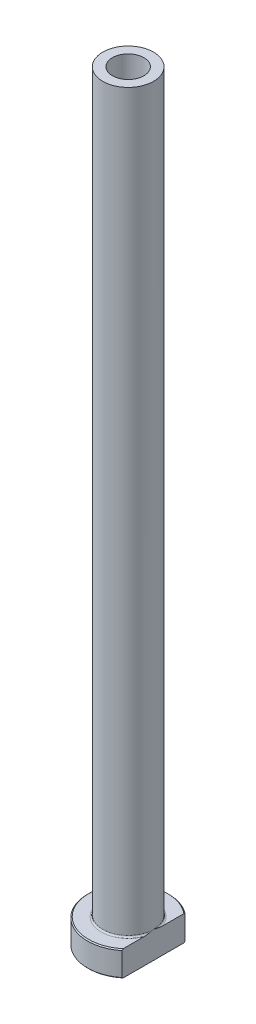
ISO-10303-21;
HEADER;
FILE_DESCRIPTION(('STEP AP214'),'2;1');
FILE_NAME('part.step','',(''),(''),'','','');
FILE_SCHEMA(('AUTOMOTIVE_DESIGN { 1 0 10303 214 1 1 1 1 }'));
ENDSEC;
DATA;
#1=APPLICATION_CONTEXT('core data for automotive mechanical design processes');
#2=APPLICATION_PROTOCOL_DEFINITION('international standard','automotive_design',2000,#1);
#3=PRODUCT_CONTEXT('',#1,'mechanical');
#4=PRODUCT('Part','Part','',(#3));
#5=PRODUCT_RELATED_PRODUCT_CATEGORY('part','',(#4));
#6=PRODUCT_DEFINITION_FORMATION('','',#4);
#7=PRODUCT_DEFINITION_CONTEXT('part definition',#1,'design');
#8=PRODUCT_DEFINITION('design','',#6,#7);
#9=PRODUCT_DEFINITION_SHAPE('','',#8);
#10=(LENGTH_UNIT() NAMED_UNIT(*) SI_UNIT(.MILLI.,.METRE.));
#11=(NAMED_UNIT(*) PLANE_ANGLE_UNIT() SI_UNIT($,.RADIAN.));
#12=(NAMED_UNIT(*) SI_UNIT($,.STERADIAN.) SOLID_ANGLE_UNIT());
#13=UNCERTAINTY_MEASURE_WITH_UNIT(LENGTH_MEASURE(1.E-05),#10,'distance_accuracy_value','');
#14=(GEOMETRIC_REPRESENTATION_CONTEXT(3) GLOBAL_UNCERTAINTY_ASSIGNED_CONTEXT((#13)) GLOBAL_UNIT_ASSIGNED_CONTEXT((#10,
#11,#12)) REPRESENTATION_CONTEXT('',''));
#15=CARTESIAN_POINT('',(0.,0.,0.));
#16=DIRECTION('',(0.,0.,1.));
#17=DIRECTION('',(1.,0.,0.));
#18=AXIS2_PLACEMENT_3D('',#15,#16,#17);
#19=CARTESIAN_POINT('',(0.,92.1876809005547,0.));
#20=DIRECTION('',(0.,1.,0.));
#21=DIRECTION('',(0.,0.,1.));
#22=AXIS2_PLACEMENT_3D('',#19,#20,#21);
#23=CYLINDRICAL_SURFACE('',#22,3.1);
#24=CARTESIAN_POINT('',(0.,150.,0.));
#25=DIRECTION('',(0.,1.,0.));
#26=DIRECTION('',(0.,0.,1.));
#27=AXIS2_PLACEMENT_3D('',#24,#25,#26);
#28=CIRCLE('',#27,3.1);
#29=CARTESIAN_POINT('',(0.,150.,3.1));
#30=VERTEX_POINT('',#29);
#31=EDGE_CURVE('E167',#30,#30,#28,.T.);
#32=ORIENTED_EDGE('',*,*,#31,.T.);
#33=EDGE_LOOP('',(#32));
#34=FACE_BOUND('',#33,.T.);
#35=CARTESIAN_POINT('',(0.,105.,0.));
#36=DIRECTION('',(0.,1.,0.));
#37=DIRECTION('',(0.,0.,1.));
#38=AXIS2_PLACEMENT_3D('',#35,#36,#37);
#39=CIRCLE('',#38,3.1);
#40=CARTESIAN_POINT('',(0.,105.,3.1));
#41=VERTEX_POINT('',#40);
#42=EDGE_CURVE('E170',#41,#41,#39,.T.);
#43=ORIENTED_EDGE('',*,*,#42,.F.);
#44=EDGE_LOOP('',(#43));
#45=FACE_BOUND('',#44,.T.);
#46=ADVANCED_FACE('F32',(#34,#45),#23,.F.);
#47=CARTESIAN_POINT('',(-3.1,150.,0.));
#48=DIRECTION('',(0.,1.,0.));
#49=DIRECTION('',(0.,0.,1.));
#50=AXIS2_PLACEMENT_3D('',#47,#48,#49);
#51=PLANE('',#50);
#52=CARTESIAN_POINT('',(0.,150.,0.));
#53=DIRECTION('',(0.,1.,0.));
#54=DIRECTION('',(0.,0.,1.));
#55=AXIS2_PLACEMENT_3D('',#52,#53,#54);
#56=CIRCLE('',#55,5.00000000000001);
#57=CARTESIAN_POINT('',(0.,150.,5.00000000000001));
#58=VERTEX_POINT('',#57);
#59=EDGE_CURVE('E174',#58,#58,#56,.T.);
#60=ORIENTED_EDGE('',*,*,#59,.T.);
#61=EDGE_LOOP('',(#60));
#62=FACE_BOUND('',#61,.T.);
#63=ORIENTED_EDGE('',*,*,#31,.F.);
#64=EDGE_LOOP('',(#63));
#65=FACE_BOUND('',#64,.T.);
#66=ADVANCED_FACE('F157',(#62,#65),#51,.T.);
#67=CARTESIAN_POINT('',(0.,92.1876809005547,0.));
#68=DIRECTION('',(0.,1.,0.));
#69=DIRECTION('',(0.,0.,1.));
#70=AXIS2_PLACEMENT_3D('',#67,#68,#69);
#71=CYLINDRICAL_SURFACE('',#70,5.);
#72=CARTESIAN_POINT('',(0.,5.3,0.));
#73=DIRECTION('',(0.,1.,0.));
#74=DIRECTION('',(0.,0.,1.));
#75=AXIS2_PLACEMENT_3D('',#72,#73,#74);
#76=CIRCLE('',#75,5.);
#77=CARTESIAN_POINT('',(5.,5.3,0.));
#78=VERTEX_POINT('',#77);
#79=EDGE_CURVE('E180',#78,#78,#76,.T.);
#80=ORIENTED_EDGE('',*,*,#79,.T.);
#81=EDGE_LOOP('',(#80));
#82=FACE_BOUND('',#81,.T.);
#83=ORIENTED_EDGE('',*,*,#59,.F.);
#84=EDGE_LOOP('',(#83));
#85=FACE_BOUND('',#84,.T.);
#86=ADVANCED_FACE('F162',(#82,#85),#71,.T.);
#87=CARTESIAN_POINT('',(-4.99999999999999,5.,0.));
#88=DIRECTION('',(0.,1.,0.));
#89=DIRECTION('',(0.,0.,1.));
#90=AXIS2_PLACEMENT_3D('',#87,#88,#89);
#91=PLANE('',#90);
#92=DIRECTION('',(0.,0.,1.));
#93=VECTOR('',#92,1.);
#94=CARTESIAN_POINT('',(5.,5.,0.));
#95=LINE('',#94,#93);
#96=CARTESIAN_POINT('',(5.,5.,-5.98665181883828));
#97=VERTEX_POINT('',#96);
#98=CARTESIAN_POINT('',(5.,5.,-1.7578395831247));
#99=VERTEX_POINT('',#98);
#100=EDGE_CURVE('E54',#97,#99,#95,.T.);
#101=ORIENTED_EDGE('',*,*,#100,.F.);
#102=CARTESIAN_POINT('',(0.,5.,0.));
#103=DIRECTION('',(0.,1.,0.));
#104=DIRECTION('',(0.,0.,1.));
#105=AXIS2_PLACEMENT_3D('',#102,#103,#104);
#106=CIRCLE('',#105,7.79999999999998);
#107=CARTESIAN_POINT('',(4.99999999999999,5.,5.98665181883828));
#108=VERTEX_POINT('',#107);
#109=EDGE_CURVE('E186',#97,#108,#106,.T.);
#110=ORIENTED_EDGE('',*,*,#109,.T.);
#111=CARTESIAN_POINT('',(5.,5.,1.7578395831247));
#112=VERTEX_POINT('',#111);
#113=EDGE_CURVE('E134',#112,#108,#95,.T.);
#114=ORIENTED_EDGE('',*,*,#113,.F.);
#115=CARTESIAN_POINT('',(0.,5.,0.));
#116=DIRECTION('',(0.,1.,0.));
#117=DIRECTION('',(0.,0.,1.));
#118=AXIS2_PLACEMENT_3D('',#115,#116,#117);
#119=CIRCLE('',#118,5.3);
#120=EDGE_CURVE('E183',#112,#99,#119,.F.);
#121=ORIENTED_EDGE('',*,*,#120,.T.);
#122=EDGE_LOOP('',(#101,#110,#114,#121));
#123=FACE_BOUND('',#122,.T.);
#124=ADVANCED_FACE('F197',(#123),#91,.T.);
#125=CARTESIAN_POINT('',(0.,92.1876809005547,0.));
#126=DIRECTION('',(0.,1.,0.));
#127=DIRECTION('',(0.,0.,1.));
#128=AXIS2_PLACEMENT_3D('',#125,#126,#127);
#129=CYLINDRICAL_SURFACE('',#128,7.99999999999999);
#130=DIRECTION('',(0.,-1.,0.));
#131=VECTOR('',#130,1.);
#132=CARTESIAN_POINT('',(4.99999999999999,150.,6.24499799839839));
#133=LINE('',#132,#131);
#134=CARTESIAN_POINT('',(4.99999999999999,4.79999999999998,6.24499799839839));
#135=VERTEX_POINT('',#134);
#136=CARTESIAN_POINT('',(4.99999999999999,0.200000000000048,6.24499799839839));
#137=VERTEX_POINT('',#136);
#138=EDGE_CURVE('E82',#135,#137,#133,.T.);
#139=ORIENTED_EDGE('',*,*,#138,.F.);
#140=CARTESIAN_POINT('',(0.,4.79999999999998,0.));
#141=DIRECTION('',(0.,1.,0.));
#142=DIRECTION('',(0.,0.,1.));
#143=AXIS2_PLACEMENT_3D('',#140,#141,#142);
#144=CIRCLE('',#143,7.99999999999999);
#145=CARTESIAN_POINT('',(5.,4.79999999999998,-6.24499799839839));
#146=VERTEX_POINT('',#145);
#147=EDGE_CURVE('E95',#135,#146,#144,.F.);
#148=ORIENTED_EDGE('',*,*,#147,.T.);
#149=DIRECTION('',(0.,-1.,0.));
#150=VECTOR('',#149,1.);
#151=CARTESIAN_POINT('',(5.,150.,-6.24499799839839));
#152=LINE('',#151,#150);
#153=CARTESIAN_POINT('',(5.,0.200000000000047,-6.24499799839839));
#154=VERTEX_POINT('',#153);
#155=EDGE_CURVE('E192',#146,#154,#152,.T.);
#156=ORIENTED_EDGE('',*,*,#155,.T.);
#157=CARTESIAN_POINT('',(0.,0.200000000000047,0.));
#158=DIRECTION('',(0.,-1.,0.));
#159=DIRECTION('',(0.,0.,-1.));
#160=AXIS2_PLACEMENT_3D('',#157,#158,#159);
#161=CIRCLE('',#160,7.99999999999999);
#162=EDGE_CURVE('E98',#154,#137,#161,.F.);
#163=ORIENTED_EDGE('',*,*,#162,.T.);
#164=EDGE_LOOP('',(#139,#148,#156,#163));
#165=FACE_BOUND('',#164,.T.);
#166=ADVANCED_FACE('F190',(#165),#129,.T.);
#167=CARTESIAN_POINT('',(-7.99999999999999,0.,0.));
#168=DIRECTION('',(0.,-1.,0.));
#169=DIRECTION('',(0.,0.,-1.));
#170=AXIS2_PLACEMENT_3D('',#167,#168,#169);
#171=PLANE('',#170);
#172=CARTESIAN_POINT('',(0.,0.,0.));
#173=DIRECTION('',(0.,-1.,0.));
#174=DIRECTION('',(0.,0.,-1.));
#175=AXIS2_PLACEMENT_3D('',#172,#173,#174);
#176=CIRCLE('',#175,3.84999999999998);
#177=CARTESIAN_POINT('',(0.,0.,-3.84999999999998));
#178=VERTEX_POINT('',#177);
#179=EDGE_CURVE('E40',#178,#178,#176,.F.);
#180=ORIENTED_EDGE('',*,*,#179,.T.);
#181=EDGE_LOOP('',(#180));
#182=FACE_BOUND('',#181,.T.);
#183=DIRECTION('',(0.,0.,-1.));
#184=VECTOR('',#183,1.);
#185=CARTESIAN_POINT('',(4.99999999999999,0.,6.24499799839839));
#186=LINE('',#185,#184);
#187=CARTESIAN_POINT('',(4.99999999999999,0.,5.98665181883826));
#188=VERTEX_POINT('',#187);
#189=CARTESIAN_POINT('',(5.,0.,-5.98665181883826));
#190=VERTEX_POINT('',#189);
#191=EDGE_CURVE('E47',#188,#190,#186,.T.);
#192=ORIENTED_EDGE('',*,*,#191,.F.);
#193=CARTESIAN_POINT('',(0.,0.,0.));
#194=DIRECTION('',(0.,-1.,0.));
#195=DIRECTION('',(0.,0.,-1.));
#196=AXIS2_PLACEMENT_3D('',#193,#194,#195);
#197=CIRCLE('',#196,7.79999999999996);
#198=EDGE_CURVE('E92',#188,#190,#197,.T.);
#199=ORIENTED_EDGE('',*,*,#198,.T.);
#200=EDGE_LOOP('',(#192,#199));
#201=FACE_BOUND('',#200,.T.);
#202=ADVANCED_FACE('F91',(#182,#201),#171,.T.);
#203=CARTESIAN_POINT('',(0.,92.1876809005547,0.));
#204=DIRECTION('',(0.,1.,0.));
#205=DIRECTION('',(0.,0.,1.));
#206=AXIS2_PLACEMENT_3D('',#203,#204,#205);
#207=CYLINDRICAL_SURFACE('',#206,3.35);
#208=CARTESIAN_POINT('',(0.,0.499999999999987,0.));
#209=DIRECTION('',(0.,-1.,0.));
#210=DIRECTION('',(0.,0.,-1.));
#211=AXIS2_PLACEMENT_3D('',#208,#209,#210);
#212=CIRCLE('',#211,3.35);
#213=CARTESIAN_POINT('',(0.,0.499999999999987,-3.35));
#214=VERTEX_POINT('',#213);
#215=EDGE_CURVE('E11',#214,#214,#212,.T.);
#216=ORIENTED_EDGE('',*,*,#215,.T.);
#217=EDGE_LOOP('',(#216));
#218=FACE_BOUND('',#217,.T.);
#219=CARTESIAN_POINT('',(0.,93.,0.));
#220=DIRECTION('',(0.,1.,0.));
#221=DIRECTION('',(0.,0.,1.));
#222=AXIS2_PLACEMENT_3D('',#219,#220,#221);
#223=CIRCLE('',#222,3.35);
#224=CARTESIAN_POINT('',(0.,93.,3.35));
#225=VERTEX_POINT('',#224);
#226=EDGE_CURVE('E172',#225,#225,#223,.T.);
#227=ORIENTED_EDGE('',*,*,#226,.T.);
#228=EDGE_LOOP('',(#227));
#229=FACE_BOUND('',#228,.T.);
#230=ADVANCED_FACE('F215',(#218,#229),#207,.F.);
#231=CARTESIAN_POINT('',(0.,93.,0.));
#232=DIRECTION('',(0.,-1.,0.));
#233=DIRECTION('',(0.,0.,-1.));
#234=AXIS2_PLACEMENT_3D('',#231,#232,#233);
#235=CONICAL_SURFACE('',#234,3.35,0.0208303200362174);
#236=ORIENTED_EDGE('',*,*,#42,.T.);
#237=EDGE_LOOP('',(#236));
#238=FACE_BOUND('',#237,.T.);
#239=ORIENTED_EDGE('',*,*,#226,.F.);
#240=EDGE_LOOP('',(#239));
#241=FACE_BOUND('',#240,.T.);
#242=ADVANCED_FACE('F111',(#238,#241),#235,.F.);
#243=CARTESIAN_POINT('',(0.,5.3,0.));
#244=DIRECTION('',(0.,1.,0.));
#245=DIRECTION('',(0.,0.,1.));
#246=AXIS2_PLACEMENT_3D('',#243,#244,#245);
#247=TOROIDAL_SURFACE('',#246,5.3,0.3);
#248=ORIENTED_EDGE('',*,*,#120,.F.);
#249=CARTESIAN_POINT('',(5.,5.3,0.));
#250=CARTESIAN_POINT('',(5.,5.30000062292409,-1.31469405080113E-10));
#251=CARTESIAN_POINT('',(5.,5.30000124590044,2.52759284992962E-07));
#252=CARTESIAN_POINT('',(5.,5.30000240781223,9.47164481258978E-07));
#253=CARTESIAN_POINT('',(5.,5.30000293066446,1.40594053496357E-06));
#254=CARTESIAN_POINT('',(5.,5.30000402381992,2.50637628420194E-06));
#255=CARTESIAN_POINT('',(5.,5.30000457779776,3.16588935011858E-06));
#256=CARTESIAN_POINT('',(5.,5.30000556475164,4.5285999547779E-06));
#257=CARTESIAN_POINT('',(5.,5.30000600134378,5.22939475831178E-06));
#258=CARTESIAN_POINT('',(5.,5.30000763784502,7.96122031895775E-06));
#259=CARTESIAN_POINT('',(5.,5.30000875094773,1.00477415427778E-05));
#260=CARTESIAN_POINT('',(5.,5.30001056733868,1.41660880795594E-05));
#261=CARTESIAN_POINT('',(5.,5.30001129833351,1.6186178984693E-05));
#262=CARTESIAN_POINT('',(5.,5.3000143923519,2.47865751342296E-05));
#263=CARTESIAN_POINT('',(5.,5.30001672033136,3.13830297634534E-05));
#264=CARTESIAN_POINT('',(5.,5.30002012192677,4.38084236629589E-05));
#265=CARTESIAN_POINT('',(5.,5.30002133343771,4.95992753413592E-05));
#266=CARTESIAN_POINT('',(5.,5.30003020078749,9.27862636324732E-05));
#267=CARTESIAN_POINT('',(5.,5.30003696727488,0.000130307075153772));
#268=CARTESIAN_POINT('',(4.99999999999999,5.30006659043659,0.000278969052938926));
#269=CARTESIAN_POINT('',(4.99999999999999,5.30009481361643,0.000389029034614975));
#270=CARTESIAN_POINT('',(5.,5.30020506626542,0.000826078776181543));
#271=CARTESIAN_POINT('',(5.,5.30028365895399,0.00115365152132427));
#272=CARTESIAN_POINT('',(4.99999999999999,5.30059919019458,0.0024592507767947));
#273=CARTESIAN_POINT('',(4.99999999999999,5.30084048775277,0.00343651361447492));
#274=CARTESIAN_POINT('',(5.,5.30184626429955,0.00752058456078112));
#275=CARTESIAN_POINT('',(5.,5.30260525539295,0.0106283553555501));
#276=CARTESIAN_POINT('',(4.99999999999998,5.30996461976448,0.0407482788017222));
#277=CARTESIAN_POINT('',(4.99999999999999,5.31658985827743,0.0677561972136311));
#278=CARTESIAN_POINT('',(5.,5.32953319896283,0.120688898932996));
#279=CARTESIAN_POINT('',(5.,5.33585289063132,0.146613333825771));
#280=CARTESIAN_POINT('',(4.99999999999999,5.34926050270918,0.201795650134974));
#281=CARTESIAN_POINT('',(5.,5.35634306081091,0.231054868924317));
#282=CARTESIAN_POINT('',(5.,5.37050252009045,0.289917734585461));
#283=CARTESIAN_POINT('',(5.,5.37757848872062,0.319521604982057));
#284=CARTESIAN_POINT('',(5.,5.39452602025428,0.391032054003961));
#285=CARTESIAN_POINT('',(5.,5.40434071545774,0.432952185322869));
#286=CARTESIAN_POINT('',(5.,5.42340141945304,0.515763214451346));
#287=CARTESIAN_POINT('',(5.,5.43265559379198,0.556652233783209));
#288=CARTESIAN_POINT('',(5.,5.45710553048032,0.667075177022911));
#289=CARTESIAN_POINT('',(5.,5.47194176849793,0.736689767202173));
#290=CARTESIAN_POINT('',(5.,5.50018229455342,0.876836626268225));
#291=CARTESIAN_POINT('',(5.,5.51357312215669,0.947371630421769));
#292=CARTESIAN_POINT('',(5.,5.53930921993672,1.09497328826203));
#293=CARTESIAN_POINT('',(5.,5.55146217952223,1.17207432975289));
#294=CARTESIAN_POINT('',(5.,5.57239669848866,1.32672649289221));
#295=CARTESIAN_POINT('',(5.,5.58117877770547,1.40427754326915));
#296=CARTESIAN_POINT('',(5.,5.59499725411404,1.56873827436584));
#297=CARTESIAN_POINT('',(5.,5.59948802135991,1.65570044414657));
#298=CARTESIAN_POINT('',(5.,5.60018885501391,1.785353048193));
#299=CARTESIAN_POINT('',(5.,5.5994521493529,1.82802575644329));
#300=CARTESIAN_POINT('',(5.,5.59559364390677,1.91325081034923));
#301=CARTESIAN_POINT('',(5.,5.59247319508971,1.95580321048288));
#302=CARTESIAN_POINT('',(5.,5.5838324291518,2.03512365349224));
#303=CARTESIAN_POINT('',(5.,5.57867386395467,2.07192937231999));
#304=CARTESIAN_POINT('',(5.,5.56543793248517,2.14526756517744));
#305=CARTESIAN_POINT('',(5.,5.55734203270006,2.18179676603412));
#306=CARTESIAN_POINT('',(5.,5.53718005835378,2.25427226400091));
#307=CARTESIAN_POINT('',(5.,5.52507057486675,2.29020746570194));
#308=CARTESIAN_POINT('',(5.,5.50270928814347,2.34223029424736));
#309=CARTESIAN_POINT('',(5.,5.49457811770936,2.35922314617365));
#310=CARTESIAN_POINT('',(5.,5.47657809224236,2.39224900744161));
#311=CARTESIAN_POINT('',(5.,5.46671281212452,2.40828390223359));
#312=CARTESIAN_POINT('',(5.,5.44695893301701,2.43579467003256));
#313=CARTESIAN_POINT('',(5.,5.43745879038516,2.44754592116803));
#314=CARTESIAN_POINT('',(5.,5.4167791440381,2.46946476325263));
#315=CARTESIAN_POINT('',(5.,5.4056054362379,2.47963758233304));
#316=CARTESIAN_POINT('',(5.,5.38617750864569,2.49393642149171));
#317=CARTESIAN_POINT('',(5.,5.3785164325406,2.49886271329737));
#318=CARTESIAN_POINT('',(5.,5.362527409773,2.50749953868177));
#319=CARTESIAN_POINT('',(5.,5.35419984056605,2.51121075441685));
#320=CARTESIAN_POINT('',(5.,5.33690648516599,2.51712941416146));
#321=CARTESIAN_POINT('',(5.,5.32793451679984,2.5193192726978));
#322=CARTESIAN_POINT('',(5.,5.30973576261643,2.52185978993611));
#323=CARTESIAN_POINT('',(5.,5.30050931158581,2.52221275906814));
#324=CARTESIAN_POINT('',(5.,5.28349166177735,2.52112455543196));
#325=CARTESIAN_POINT('',(5.,5.27568322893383,2.51993178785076));
#326=CARTESIAN_POINT('',(5.,5.26036860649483,2.51628294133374));
#327=CARTESIAN_POINT('',(5.,5.25286261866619,2.51382603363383));
#328=CARTESIAN_POINT('',(5.,5.2359026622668,2.50685484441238));
#329=CARTESIAN_POINT('',(5.,5.22661875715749,2.50192984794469));
#330=CARTESIAN_POINT('',(5.,5.20895514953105,2.49066548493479));
#331=CARTESIAN_POINT('',(5.,5.20057756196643,2.48432291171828));
#332=CARTESIAN_POINT('',(5.,5.1798700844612,2.46645212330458));
#333=CARTESIAN_POINT('',(5.,5.16824151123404,2.45411867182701));
#334=CARTESIAN_POINT('',(5.,5.14692461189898,2.42790849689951));
#335=CARTESIAN_POINT('',(5.,5.13723987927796,2.41402898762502));
#336=CARTESIAN_POINT('',(5.,5.11080706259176,2.37143175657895));
#337=CARTESIAN_POINT('',(5.,5.09628770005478,2.34134703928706));
#338=CARTESIAN_POINT('',(5.,5.07130349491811,2.27940731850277));
#339=CARTESIAN_POINT('',(5.,5.06087110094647,2.24754035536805));
#340=CARTESIAN_POINT('',(5.,5.03890359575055,2.16787245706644));
#341=CARTESIAN_POINT('',(5.,5.02913523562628,2.1195906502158));
#342=CARTESIAN_POINT('',(5.,5.01416953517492,2.02224928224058));
#343=CARTESIAN_POINT('',(5.,5.00898637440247,1.97318778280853));
#344=CARTESIAN_POINT('',(5.,5.00220823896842,1.87635767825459));
#345=CARTESIAN_POINT('',(5.,5.00050709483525,1.82859609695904));
#346=CARTESIAN_POINT('',(5.,4.999691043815,1.73330165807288));
#347=CARTESIAN_POINT('',(5.,5.00056327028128,1.68576884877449));
#348=CARTESIAN_POINT('',(5.,5.00484296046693,1.57937770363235));
#349=CARTESIAN_POINT('',(5.,5.00880932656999,1.52054285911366));
#350=CARTESIAN_POINT('',(5.,5.01925964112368,1.40312974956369));
#351=CARTESIAN_POINT('',(5.,5.02574264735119,1.34455139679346));
#352=CARTESIAN_POINT('',(5.,5.04090087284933,1.22627662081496));
#353=CARTESIAN_POINT('',(5.,5.04962425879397,1.16658647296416));
#354=CARTESIAN_POINT('',(5.,5.06877923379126,1.04732463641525));
#355=CARTESIAN_POINT('',(5.,5.07921523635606,0.987753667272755));
#356=CARTESIAN_POINT('',(5.,5.10551698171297,0.846936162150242));
#357=CARTESIAN_POINT('',(5.,5.12196565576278,0.765799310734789));
#358=CARTESIAN_POINT('',(5.,5.15639716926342,0.604819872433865));
#359=CARTESIAN_POINT('',(5.,5.17436050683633,0.524973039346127));
#360=CARTESIAN_POINT('',(4.99999999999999,5.2092166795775,0.374726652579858));
#361=CARTESIAN_POINT('',(4.99999999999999,5.22599388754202,0.304300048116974));
#362=CARTESIAN_POINT('',(5.,5.25191105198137,0.196907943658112));
#363=CARTESIAN_POINT('',(5.,5.26090146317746,0.159905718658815));
#364=CARTESIAN_POINT('',(4.99999999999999,5.27881854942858,0.0865164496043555));
#365=CARTESIAN_POINT('',(4.99999999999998,5.28774391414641,0.0501291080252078));
#366=CARTESIAN_POINT('',(5.,5.2973962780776,0.0106218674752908));
#367=CARTESIAN_POINT('',(5.,5.29815688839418,0.00750762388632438));
#368=CARTESIAN_POINT('',(4.99999999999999,5.29916304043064,0.00342209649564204));
#369=CARTESIAN_POINT('',(4.99999999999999,5.29940309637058,0.00244985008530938));
#370=CARTESIAN_POINT('',(5.,5.29971711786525,0.00115049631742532));
#371=CARTESIAN_POINT('',(5.,5.29979541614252,0.000824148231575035));
#372=CARTESIAN_POINT('',(4.99999999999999,5.29990531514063,0.000388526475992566));
#373=CARTESIAN_POINT('',(4.99999999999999,5.299933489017,0.000278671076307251));
#374=CARTESIAN_POINT('',(5.,5.29996306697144,0.000130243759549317));
#375=CARTESIAN_POINT('',(5.,5.29996982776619,9.27511401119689E-05));
#376=CARTESIAN_POINT('',(5.,5.29997868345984,4.95929903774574E-05));
#377=CARTESIAN_POINT('',(5.,5.29997989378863,4.38036571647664E-05));
#378=CARTESIAN_POINT('',(5.,5.29998329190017,3.13814199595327E-05));
#379=CARTESIAN_POINT('',(5.,5.29998561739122,2.47865230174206E-05));
#380=CARTESIAN_POINT('',(5.,5.29998870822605,1.61877553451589E-05));
#381=CARTESIAN_POINT('',(5.,5.29998943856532,1.41677775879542E-05));
#382=CARTESIAN_POINT('',(5.,5.29999125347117,1.00495537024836E-05));
#383=CARTESIAN_POINT('',(5.,5.29999236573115,7.96302707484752E-06));
#384=CARTESIAN_POINT('',(5.,5.29999400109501,5.23107447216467E-06));
#385=CARTESIAN_POINT('',(5.,5.29999443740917,4.53021065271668E-06));
#386=CARTESIAN_POINT('',(5.,5.29999542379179,3.16731183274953E-06));
#387=CARTESIAN_POINT('',(5.,5.29999597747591,2.50767750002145E-06));
#388=CARTESIAN_POINT('',(5.,5.29999707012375,1.40695895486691E-06));
#389=CARTESIAN_POINT('',(5.,5.29999759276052,9.48032589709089E-07));
#390=CARTESIAN_POINT('',(5.,5.29999875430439,2.53244394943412E-07));
#391=CARTESIAN_POINT('',(5.,5.29999937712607,1.31460206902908E-10));
#392=CARTESIAN_POINT('',(5.,5.3,0.));
#393=B_SPLINE_CURVE_WITH_KNOTS('',3,(#249,#250,#251,#252,#253,#254,#255,#256,#257,#258,#259,
#260,#261,#262,#263,#264,#265,#266,#267,#268,#269,#270,#271,#272,#273,#274,#275,#276,#277,#278,
#279,#280,#281,#282,#283,#284,#285,#286,#287,#288,#289,#290,#291,#292,#293,#294,#295,#296,#297,
#298,#299,#300,#301,#302,#303,#304,#305,#306,#307,#308,#309,#310,#311,#312,#313,#314,#315,#316,
#317,#318,#319,#320,#321,#322,#323,#324,#325,#326,#327,#328,#329,#330,#331,#332,#333,#334,#335,
#336,#337,#338,#339,#340,#341,#342,#343,#344,#345,#346,#347,#348,#349,#350,#351,#352,#353,#354,
#355,#356,#357,#358,#359,#360,#361,#362,#363,#364,#365,#366,#367,#368,#369,#370,#371,#372,#373,
#374,#375,#376,#377,#378,#379,#380,#381,#382,#383,#384,#385,#386,#387,#388,#389,#390,#391,#392),
.UNSPECIFIED.,.T.,.F.,(4,2,2,2,2,2,2,2,2,2,2,2,2,2,2,2,2,2,2,2,2,2,2,2,2,2,2,2,2,2,2,2,2,2,2,2,
2,2,2,2,2,2,2,2,2,2,2,2,2,2,2,2,2,2,2,2,2,2,2,2,2,2,2,2,2,2,2,2,2,2,2,4),(0.,
1.88939227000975E-06,3.98058756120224E-06,6.54818360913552E-06,9.02404134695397E-06,
1.60938721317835E-05,2.25328161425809E-05,4.34843886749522E-05,6.12120154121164E-05,
0.00017562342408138,0.000516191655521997,0.00152710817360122,0.0045465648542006,
0.0141443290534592,0.0975679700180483,0.177619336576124,0.267931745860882,0.359245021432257,
0.488405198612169,0.614173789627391,0.827694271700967,1.04305715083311,1.27715608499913,
1.51121890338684,1.77214751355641,1.90013509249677,2.02805018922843,2.13945459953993,
2.25157451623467,2.36494894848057,2.42139235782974,2.4777207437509,2.52293802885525,
2.56800219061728,2.59524342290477,2.62246933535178,2.65000494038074,2.67750590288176,
2.70108948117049,2.72468854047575,2.75603978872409,2.78746268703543,2.83802806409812,
2.88868607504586,2.98834295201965,3.08877575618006,3.23618650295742,3.38405153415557,
3.52733651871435,3.66990630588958,3.84673903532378,4.02350562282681,4.20444776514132,
4.38586374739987,4.63419556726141,4.87971270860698,5.09690175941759,5.21113882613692,
5.32353360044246,5.33315137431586,5.33615533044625,5.33716246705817,5.33750240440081,
5.33761672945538,5.33763445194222,5.33765539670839,5.3376618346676,5.33766890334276,
5.33767137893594,5.33767394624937,5.33767603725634,5.33767792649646),.UNSPECIFIED.);
#394=EDGE_CURVE('E126',#112,#78,#393,.T.);
#395=ORIENTED_EDGE('',*,*,#394,.T.);
#396=ORIENTED_EDGE('',*,*,#79,.F.);
#397=CARTESIAN_POINT('',(5.,5.3,0.));
#398=CARTESIAN_POINT('',(5.,5.29999937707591,1.3147082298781E-10));
#399=CARTESIAN_POINT('',(5.,5.29999875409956,-2.5275928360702E-07));
#400=CARTESIAN_POINT('',(5.,5.29999759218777,-9.47164479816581E-07));
#401=CARTESIAN_POINT('',(5.,5.29999706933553,-1.40594053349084E-06));
#402=CARTESIAN_POINT('',(5.,5.29999597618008,-2.50637628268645E-06));
#403=CARTESIAN_POINT('',(5.,5.29999542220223,-3.16588934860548E-06));
#404=CARTESIAN_POINT('',(5.,5.29999443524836,-4.52859995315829E-06));
#405=CARTESIAN_POINT('',(5.,5.29999399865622,-5.22939475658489E-06));
#406=CARTESIAN_POINT('',(5.,5.29999236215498,-7.96122031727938E-06));
#407=CARTESIAN_POINT('',(5.,5.29999124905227,-1.00477415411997E-05));
#408=CARTESIAN_POINT('',(5.,5.29998943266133,-1.41660880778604E-05));
#409=CARTESIAN_POINT('',(5.,5.2999887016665,-1.61861789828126E-05));
#410=CARTESIAN_POINT('',(5.,5.2999856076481,-2.47865751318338E-05));
#411=CARTESIAN_POINT('',(5.,5.29998327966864,-3.13830297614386E-05));
#412=CARTESIAN_POINT('',(5.,5.29997987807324,-4.38084236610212E-05));
#413=CARTESIAN_POINT('',(5.,5.2999786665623,-4.95992753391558E-05));
#414=CARTESIAN_POINT('',(5.,5.29996979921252,-9.27862636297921E-05));
#415=CARTESIAN_POINT('',(5.,5.29996303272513,-0.000130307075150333));
#416=CARTESIAN_POINT('',(4.99999999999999,5.29993340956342,-0.000278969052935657));
#417=CARTESIAN_POINT('',(4.99999999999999,5.29990518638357,-0.000389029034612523));
#418=CARTESIAN_POINT('',(5.,5.29979493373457,-0.000826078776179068));
#419=CARTESIAN_POINT('',(5.,5.29971634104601,-0.00115365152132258));
#420=CARTESIAN_POINT('',(4.99999999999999,5.29940080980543,-0.00245925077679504));
#421=CARTESIAN_POINT('',(4.99999999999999,5.29915951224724,-0.0034365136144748));
#422=CARTESIAN_POINT('',(5.,5.29815373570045,-0.00752058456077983));
#423=CARTESIAN_POINT('',(5.,5.29739474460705,-0.0106283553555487));
#424=CARTESIAN_POINT('',(4.99999999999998,5.2900353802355,-0.0407482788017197));
#425=CARTESIAN_POINT('',(4.99999999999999,5.28341014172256,-0.0677561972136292));
#426=CARTESIAN_POINT('',(5.,5.27046680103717,-0.120688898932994));
#427=CARTESIAN_POINT('',(5.,5.26414710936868,-0.146613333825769));
#428=CARTESIAN_POINT('',(4.99999999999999,5.25073949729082,-0.201795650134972));
#429=CARTESIAN_POINT('',(5.,5.24365693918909,-0.231054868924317));
#430=CARTESIAN_POINT('',(5.,5.22949747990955,-0.289917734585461));
#431=CARTESIAN_POINT('',(5.,5.22242151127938,-0.319521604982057));
#432=CARTESIAN_POINT('',(5.,5.20547397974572,-0.391032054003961));
#433=CARTESIAN_POINT('',(5.,5.19565928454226,-0.432952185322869));
#434=CARTESIAN_POINT('',(5.,5.17659858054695,-0.515763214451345));
#435=CARTESIAN_POINT('',(5.,5.16734440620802,-0.556652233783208));
#436=CARTESIAN_POINT('',(5.,5.14289446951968,-0.667075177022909));
#437=CARTESIAN_POINT('',(5.,5.12805823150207,-0.736689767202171));
#438=CARTESIAN_POINT('',(5.,5.09981770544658,-0.876836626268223));
#439=CARTESIAN_POINT('',(5.,5.0864268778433,-0.947371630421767));
#440=CARTESIAN_POINT('',(5.,5.06069078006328,-1.09497328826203));
#441=CARTESIAN_POINT('',(5.,5.04853782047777,-1.17207432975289));
#442=CARTESIAN_POINT('',(5.,5.02760330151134,-1.3267264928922));
#443=CARTESIAN_POINT('',(5.,5.01882122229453,-1.40427754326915));
#444=CARTESIAN_POINT('',(5.,5.00500274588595,-1.56873827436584));
#445=CARTESIAN_POINT('',(5.,5.00051197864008,-1.65570044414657));
#446=CARTESIAN_POINT('',(5.,4.99981114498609,-1.785353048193));
#447=CARTESIAN_POINT('',(5.,5.0005478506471,-1.82802575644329));
#448=CARTESIAN_POINT('',(5.,5.00440635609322,-1.91325081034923));
#449=CARTESIAN_POINT('',(5.,5.00752680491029,-1.95580321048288));
#450=CARTESIAN_POINT('',(5.,5.0161675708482,-2.03512365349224));
#451=CARTESIAN_POINT('',(5.,5.02132613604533,-2.07192937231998));
#452=CARTESIAN_POINT('',(5.,5.03456206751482,-2.14526756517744));
#453=CARTESIAN_POINT('',(5.,5.04265796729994,-2.18179676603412));
#454=CARTESIAN_POINT('',(5.,5.06281994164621,-2.2542722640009));
#455=CARTESIAN_POINT('',(5.,5.07492942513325,-2.29020746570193));
#456=CARTESIAN_POINT('',(5.,5.09729071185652,-2.34223029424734));
#457=CARTESIAN_POINT('',(5.,5.10542188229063,-2.35922314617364));
#458=CARTESIAN_POINT('',(5.,5.12342190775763,-2.39224900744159));
#459=CARTESIAN_POINT('',(5.,5.13328718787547,-2.40828390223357));
#460=CARTESIAN_POINT('',(5.,5.15304106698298,-2.43579467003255));
#461=CARTESIAN_POINT('',(5.,5.16254120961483,-2.44754592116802));
#462=CARTESIAN_POINT('',(5.,5.18322085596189,-2.46946476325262));
#463=CARTESIAN_POINT('',(5.,5.19439456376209,-2.47963758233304));
#464=CARTESIAN_POINT('',(5.,5.2138224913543,-2.49393642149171));
#465=CARTESIAN_POINT('',(5.,5.22148356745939,-2.49886271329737));
#466=CARTESIAN_POINT('',(5.,5.237472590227,-2.50749953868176));
#467=CARTESIAN_POINT('',(5.,5.24580015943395,-2.51121075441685));
#468=CARTESIAN_POINT('',(5.,5.26309351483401,-2.51712941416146));
#469=CARTESIAN_POINT('',(5.,5.27206548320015,-2.5193192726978));
#470=CARTESIAN_POINT('',(5.,5.29026423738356,-2.52185978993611));
#471=CARTESIAN_POINT('',(5.,5.29949068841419,-2.52221275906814));
#472=CARTESIAN_POINT('',(5.,5.31650833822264,-2.52112455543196));
#473=CARTESIAN_POINT('',(5.,5.32431677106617,-2.51993178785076));
#474=CARTESIAN_POINT('',(5.,5.33963139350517,-2.51628294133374));
#475=CARTESIAN_POINT('',(5.,5.34713738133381,-2.51382603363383));
#476=CARTESIAN_POINT('',(5.,5.3640973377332,-2.50685484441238));
#477=CARTESIAN_POINT('',(5.,5.3733812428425,-2.50192984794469));
#478=CARTESIAN_POINT('',(5.,5.39104485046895,-2.4906654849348));
#479=CARTESIAN_POINT('',(5.,5.39942243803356,-2.48432291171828));
#480=CARTESIAN_POINT('',(5.,5.42012991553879,-2.46645212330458));
#481=CARTESIAN_POINT('',(5.,5.43175848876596,-2.45411867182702));
#482=CARTESIAN_POINT('',(5.,5.45307538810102,-2.42790849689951));
#483=CARTESIAN_POINT('',(5.,5.46276012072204,-2.41402898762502));
#484=CARTESIAN_POINT('',(5.,5.48919293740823,-2.37143175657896));
#485=CARTESIAN_POINT('',(5.,5.50371229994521,-2.34134703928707));
#486=CARTESIAN_POINT('',(5.,5.52869650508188,-2.27940731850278));
#487=CARTESIAN_POINT('',(5.,5.53912889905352,-2.24754035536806));
#488=CARTESIAN_POINT('',(5.,5.56109640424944,-2.16787245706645));
#489=CARTESIAN_POINT('',(5.,5.57086476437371,-2.11959065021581));
#490=CARTESIAN_POINT('',(5.,5.58583046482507,-2.0222492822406));
#491=CARTESIAN_POINT('',(5.,5.59101362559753,-1.97318778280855));
#492=CARTESIAN_POINT('',(5.,5.59779176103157,-1.87635767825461));
#493=CARTESIAN_POINT('',(5.,5.59949290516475,-1.82859609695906));
#494=CARTESIAN_POINT('',(5.,5.600308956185,-1.73330165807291));
#495=CARTESIAN_POINT('',(5.,5.59943672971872,-1.68576884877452));
#496=CARTESIAN_POINT('',(5.,5.59515703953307,-1.57937770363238));
#497=CARTESIAN_POINT('',(5.,5.59119067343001,-1.52054285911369));
#498=CARTESIAN_POINT('',(5.,5.58074035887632,-1.40312974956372));
#499=CARTESIAN_POINT('',(5.,5.57425735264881,-1.34455139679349));
#500=CARTESIAN_POINT('',(5.,5.55909912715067,-1.22627662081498));
#501=CARTESIAN_POINT('',(5.,5.55037574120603,-1.16658647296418));
#502=CARTESIAN_POINT('',(5.,5.53122076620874,-1.04732463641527));
#503=CARTESIAN_POINT('',(5.,5.52078476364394,-0.987753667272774));
#504=CARTESIAN_POINT('',(5.,5.49448301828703,-0.846936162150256));
#505=CARTESIAN_POINT('',(5.,5.47803434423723,-0.765799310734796));
#506=CARTESIAN_POINT('',(5.,5.44360283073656,-0.604819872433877));
#507=CARTESIAN_POINT('',(5.,5.4256394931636,-0.524973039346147));
#508=CARTESIAN_POINT('',(4.99999999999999,5.39078332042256,-0.374726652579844));
#509=CARTESIAN_POINT('',(4.99999999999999,5.37400611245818,-0.304300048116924));
#510=CARTESIAN_POINT('',(5.,5.34808894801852,-0.196907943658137));
#511=CARTESIAN_POINT('',(5.,5.33909853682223,-0.159905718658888));
#512=CARTESIAN_POINT('',(4.99999999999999,5.32118145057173,-0.0865164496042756));
#513=CARTESIAN_POINT('',(4.99999999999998,5.3122560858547,-0.0501291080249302));
#514=CARTESIAN_POINT('',(5.,5.3026037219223,-0.0106218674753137));
#515=CARTESIAN_POINT('',(5.,5.30184311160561,-0.00750762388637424));
#516=CARTESIAN_POINT('',(4.99999999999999,5.30083695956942,-0.0034220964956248));
#517=CARTESIAN_POINT('',(4.99999999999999,5.30059690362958,-0.00244985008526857));
#518=CARTESIAN_POINT('',(5.,5.3002828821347,-0.00115049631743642));
#519=CARTESIAN_POINT('',(5.,5.30020458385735,-0.000824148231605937));
#520=CARTESIAN_POINT('',(4.99999999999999,5.30009468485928,-0.000388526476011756));
#521=CARTESIAN_POINT('',(4.99999999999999,5.30006651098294,-0.000278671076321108));
#522=CARTESIAN_POINT('',(5.,5.30003693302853,-0.000130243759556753));
#523=CARTESIAN_POINT('',(5.,5.30003017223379,-9.27511401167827E-05));
#524=CARTESIAN_POINT('',(5.,5.30002131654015,-4.95929903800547E-05));
#525=CARTESIAN_POINT('',(5.,5.30002010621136,-4.38036571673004E-05));
#526=CARTESIAN_POINT('',(5.,5.30001670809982,-3.13814199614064E-05));
#527=CARTESIAN_POINT('',(5.,5.30001438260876,-2.47865230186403E-05));
#528=CARTESIAN_POINT('',(5.,5.30001129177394,-1.61877553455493E-05));
#529=CARTESIAN_POINT('',(5.,5.30001056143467,-1.41677775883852E-05));
#530=CARTESIAN_POINT('',(5.,5.30000874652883,-1.00495537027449E-05));
#531=CARTESIAN_POINT('',(5.,5.30000763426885,-7.96302707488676E-06));
#532=CARTESIAN_POINT('',(5.,5.30000599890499,-5.23107447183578E-06));
#533=CARTESIAN_POINT('',(5.,5.30000556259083,-4.53021065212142E-06));
#534=CARTESIAN_POINT('',(5.,5.30000457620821,-3.1673118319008E-06));
#535=CARTESIAN_POINT('',(5.,5.30000402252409,-2.50767749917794E-06));
#536=CARTESIAN_POINT('',(5.,5.30000292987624,-1.4069589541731E-06));
#537=CARTESIAN_POINT('',(5.,5.30000240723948,-9.4803258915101E-07));
#538=CARTESIAN_POINT('',(5.,5.30000124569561,-2.53244393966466E-07));
#539=CARTESIAN_POINT('',(5.,5.30000062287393,-1.31458847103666E-10));
#540=CARTESIAN_POINT('',(5.,5.3,0.));
#541=B_SPLINE_CURVE_WITH_KNOTS('',3,(#397,#398,#399,#400,#401,#402,#403,#404,#405,#406,#407,
#408,#409,#410,#411,#412,#413,#414,#415,#416,#417,#418,#419,#420,#421,#422,#423,#424,#425,#426,
#427,#428,#429,#430,#431,#432,#433,#434,#435,#436,#437,#438,#439,#440,#441,#442,#443,#444,#445,
#446,#447,#448,#449,#450,#451,#452,#453,#454,#455,#456,#457,#458,#459,#460,#461,#462,#463,#464,
#465,#466,#467,#468,#469,#470,#471,#472,#473,#474,#475,#476,#477,#478,#479,#480,#481,#482,#483,
#484,#485,#486,#487,#488,#489,#490,#491,#492,#493,#494,#495,#496,#497,#498,#499,#500,#501,#502,
#503,#504,#505,#506,#507,#508,#509,#510,#511,#512,#513,#514,#515,#516,#517,#518,#519,#520,#521,
#522,#523,#524,#525,#526,#527,#528,#529,#530,#531,#532,#533,#534,#535,#536,#537,#538,#539,#540),
.UNSPECIFIED.,.T.,.F.,(4,2,2,2,2,2,2,2,2,2,2,2,2,2,2,2,2,2,2,2,2,2,2,2,2,2,2,2,2,2,2,2,2,2,2,2,
2,2,2,2,2,2,2,2,2,2,2,2,2,2,2,2,2,2,2,2,2,2,2,2,2,2,2,2,2,2,2,2,2,2,2,4),(0.,
1.88939226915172E-06,3.98058756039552E-06,6.54818360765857E-06,9.02404134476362E-06,
1.60938721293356E-05,2.25328161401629E-05,4.34843886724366E-05,6.12120154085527E-05,
0.000175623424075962,0.000516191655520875,0.00152710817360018,0.00454656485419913,
0.0141443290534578,0.0975679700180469,0.177619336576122,0.267931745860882,0.359245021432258,
0.488405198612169,0.614173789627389,0.827694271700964,1.04305715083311,1.27715608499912,
1.51121890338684,1.77214751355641,1.90013509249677,2.02805018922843,2.13945459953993,
2.25157451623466,2.36494894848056,2.42139235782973,2.47772074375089,2.52293802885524,
2.56800219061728,2.59524342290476,2.62246933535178,2.65000494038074,2.67750590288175,
2.70108948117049,2.72468854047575,2.75603978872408,2.78746268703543,2.83802806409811,
2.88868607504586,2.98834295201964,3.08877575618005,3.2361865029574,3.38405153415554,
3.52733651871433,3.66990630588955,3.84673903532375,4.02350562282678,4.2044477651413,
4.38586374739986,4.6341955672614,4.87971270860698,5.09690175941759,5.21113882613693,
5.32353360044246,5.33315137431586,5.33615533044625,5.33716246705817,5.33750240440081,
5.33761672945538,5.33763445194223,5.33765539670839,5.3376618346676,5.33766890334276,
5.33767137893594,5.33767394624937,5.33767603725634,5.33767792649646),.UNSPECIFIED.);
#542=EDGE_CURVE('E135',#78,#99,#541,.T.);
#543=ORIENTED_EDGE('',*,*,#542,.T.);
#544=EDGE_LOOP('',(#248,#395,#396,#543));
#545=FACE_BOUND('',#544,.T.);
#546=ADVANCED_FACE('F141',(#545),#247,.F.);
#547=CARTESIAN_POINT('',(0.,5.,0.));
#548=DIRECTION('',(0.,-1.,0.));
#549=DIRECTION('',(0.,0.,-1.));
#550=AXIS2_PLACEMENT_3D('',#547,#548,#549);
#551=CONICAL_SURFACE('',#550,7.79999999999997,0.78539816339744);
#552=CARTESIAN_POINT('',(5.,-1.82162423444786,-13.7401563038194));
#553=CARTESIAN_POINT('',(5.,-1.61889813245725,-13.5244204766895));
#554=CARTESIAN_POINT('',(5.,-1.4164638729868,-13.3084101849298));
#555=CARTESIAN_POINT('',(5.,-1.01227657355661,-12.8757508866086));
#556=CARTESIAN_POINT('',(5.,-0.810523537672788,-12.6591018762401));
#557=CARTESIAN_POINT('',(5.,-0.206157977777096,-12.0077661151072));
#558=CARTESIAN_POINT('',(5.,0.195280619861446,-11.5719884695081));
#559=CARTESIAN_POINT('',(5.,1.00388282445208,-10.6856136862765));
#560=CARTESIAN_POINT('',(5.,1.4109390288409,-10.2349182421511));
#561=CARTESIAN_POINT('',(5.,2.01658324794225,-9.55471676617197));
#562=CARTESIAN_POINT('',(5.,2.21758236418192,-9.32735800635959));
#563=CARTESIAN_POINT('',(5.,2.61761142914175,-8.87091599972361));
#564=CARTESIAN_POINT('',(5.,2.8166413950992,-8.64183276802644));
#565=CARTESIAN_POINT('',(5.,3.21217345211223,-8.18170099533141));
#566=CARTESIAN_POINT('',(5.,3.4086768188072,-7.95065355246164));
#567=CARTESIAN_POINT('',(5.,3.79865427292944,-7.48599989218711));
#568=CARTESIAN_POINT('',(5.,3.9921282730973,-7.25239360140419));
#569=CARTESIAN_POINT('',(5.,4.37558160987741,-6.78155890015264));
#570=CARTESIAN_POINT('',(5.,4.56555334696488,-6.54432428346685));
#571=CARTESIAN_POINT('',(5.,4.94042138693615,-6.06589574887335));
#572=CARTESIAN_POINT('',(5.,5.125318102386,-5.82470215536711));
#573=CARTESIAN_POINT('',(5.,5.48653546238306,-5.33972956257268));
#574=CARTESIAN_POINT('',(5.,5.66292392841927,-5.09600137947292));
#575=CARTESIAN_POINT('',(5.,6.00675382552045,-4.60213647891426));
#576=CARTESIAN_POINT('',(5.,6.1741916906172,-4.35199726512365));
#577=CARTESIAN_POINT('',(5.,6.49592993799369,-3.84445040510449));
#578=CARTESIAN_POINT('',(5.,6.65027272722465,-3.58707012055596));
#579=CARTESIAN_POINT('',(5.,6.86813414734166,-3.19356592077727));
#580=CARTESIAN_POINT('',(5.,6.93845533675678,-3.06120993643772));
#581=CARTESIAN_POINT('',(5.,7.07360441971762,-2.7937331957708));
#582=CARTESIAN_POINT('',(5.,7.13843319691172,-2.65861288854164));
#583=CARTESIAN_POINT('',(5.,7.26869642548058,-2.36936389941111));
#584=CARTESIAN_POINT('',(5.,7.33331212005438,-2.21486278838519));
#585=CARTESIAN_POINT('',(5.,7.45243473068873,-1.90194073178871));
#586=CARTESIAN_POINT('',(5.,7.50694001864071,-1.74351915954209));
#587=CARTESIAN_POINT('',(5.,7.60343746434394,-1.42384276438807));
#588=CARTESIAN_POINT('',(5.,7.64549910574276,-1.26260921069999));
#589=CARTESIAN_POINT('',(5.,7.71543089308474,-0.937062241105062));
#590=CARTESIAN_POINT('',(5.,7.74330266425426,-0.77274918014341));
#591=CARTESIAN_POINT('',(5.,7.78344284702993,-0.439876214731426));
#592=CARTESIAN_POINT('',(5.,7.79548961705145,-0.271289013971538));
#593=CARTESIAN_POINT('',(5.,7.80240809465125,0.0662275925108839));
#594=CARTESIAN_POINT('',(5.,7.79728142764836,0.235156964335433));
#595=CARTESIAN_POINT('',(5.,7.77017954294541,0.572209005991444));
#596=CARTESIAN_POINT('',(5.,7.74814735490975,0.74032700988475));
#597=CARTESIAN_POINT('',(5.,7.68863212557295,1.07379849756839));
#598=CARTESIAN_POINT('',(5.,7.65114437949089,1.23915112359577));
#599=CARTESIAN_POINT('',(5.,7.54734433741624,1.62344926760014));
#600=CARTESIAN_POINT('',(5.,7.47553580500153,1.84089917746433));
#601=CARTESIAN_POINT('',(5.,7.31300119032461,2.26856946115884));
#602=CARTESIAN_POINT('',(5.,7.22226460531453,2.47878574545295));
#603=CARTESIAN_POINT('',(5.,7.07492970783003,2.79014067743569));
#604=CARTESIAN_POINT('',(5.,7.02362278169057,2.89384077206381));
#605=CARTESIAN_POINT('',(5.,6.91783840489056,3.09961626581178));
#606=CARTESIAN_POINT('',(4.99999999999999,6.86336091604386,3.20169164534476));
#607=CARTESIAN_POINT('',(4.99999999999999,6.75169048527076,3.40428995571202));
#608=CARTESIAN_POINT('',(4.99999999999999,6.69449856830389,3.50481345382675));
#609=CARTESIAN_POINT('',(4.99999999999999,6.57774196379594,3.70446206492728));
#610=CARTESIAN_POINT('',(4.99999999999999,6.51817739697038,3.80358724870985));
#611=CARTESIAN_POINT('',(4.99999999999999,6.30853654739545,4.14435766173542));
#612=CARTESIAN_POINT('',(4.99999999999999,6.15326588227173,4.38281352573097));
#613=CARTESIAN_POINT('',(4.99999999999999,5.83377190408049,4.85367607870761));
#614=CARTESIAN_POINT('',(4.99999999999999,5.66954595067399,5.08608095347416));
#615=CARTESIAN_POINT('',(4.99999999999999,5.3343169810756,5.5462855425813));
#616=CARTESIAN_POINT('',(4.99999999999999,5.16330740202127,5.77408045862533));
#617=CARTESIAN_POINT('',(4.99999999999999,4.8162992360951,6.22578157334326));
#618=CARTESIAN_POINT('',(4.99999999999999,4.64030119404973,6.44968819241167));
#619=CARTESIAN_POINT('',(4.99999999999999,4.28368615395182,6.8953257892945));
#620=CARTESIAN_POINT('',(4.99999999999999,4.10305289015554,7.11704371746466));
#621=CARTESIAN_POINT('',(4.99999999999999,3.7387071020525,7.55793799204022));
#622=CARTESIAN_POINT('',(4.99999999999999,3.55499450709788,7.77711427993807));
#623=CARTESIAN_POINT('',(4.99999999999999,3.18521083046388,8.21325328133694));
#624=CARTESIAN_POINT('',(4.99999999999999,2.99914113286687,8.43021717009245));
#625=CARTESIAN_POINT('',(4.99999999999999,2.6249981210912,8.86241167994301));
#626=CARTESIAN_POINT('',(4.99999999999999,2.43692478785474,9.07764228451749));
#627=CARTESIAN_POINT('',(4.99999999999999,1.91463404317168,9.67075518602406));
#628=CARTESIAN_POINT('',(4.99999999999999,1.57868086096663,10.0471086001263));
#629=CARTESIAN_POINT('',(4.99999999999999,0.903003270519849,10.7965122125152));
#630=CARTESIAN_POINT('',(4.99999999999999,0.563278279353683,11.169561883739));
#631=CARTESIAN_POINT('',(4.99999999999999,-0.116149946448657,11.9100168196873));
#632=CARTESIAN_POINT('',(4.99999999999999,-0.455830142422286,12.2774432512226));
#633=CARTESIAN_POINT('',(4.99999999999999,-1.13728640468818,13.0102135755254));
#634=CARTESIAN_POINT('',(4.99999999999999,-1.47906204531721,13.3755578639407));
#635=CARTESIAN_POINT('',(4.99999999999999,-1.82162423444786,13.7401563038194));
#636=B_SPLINE_CURVE_WITH_KNOTS('',3,(#552,#553,#554,#555,#556,#557,#558,#559,#560,#561,#562,
#563,#564,#565,#566,#567,#568,#569,#570,#571,#572,#573,#574,#575,#576,#577,#578,#579,#580,#581,
#582,#583,#584,#585,#586,#587,#588,#589,#590,#591,#592,#593,#594,#595,#596,#597,#598,#599,#600,
#601,#602,#603,#604,#605,#606,#607,#608,#609,#610,#611,#612,#613,#614,#615,#616,#617,#618,#619,
#620,#621,#622,#623,#624,#625,#626,#627,#628,#629,#630,#631,#632,#633,#634,#635),.UNSPECIFIED.,
.F.,.F.,(4,2,2,2,2,2,2,2,2,2,2,2,2,2,2,2,2,2,2,2,2,2,2,2,2,2,2,2,2,2,2,2,2,2,2,2,2,2,2,2,2,4),
(0.,0.888120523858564,1.77624635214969,3.55372511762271,5.3755948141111,6.28598924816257,
7.19637570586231,8.10628289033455,9.016216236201,9.92793449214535,10.8395784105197,
11.7420025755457,12.6447836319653,13.5445196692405,13.9940505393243,14.4435089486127,
14.9456212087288,15.4478142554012,15.947147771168,16.4464240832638,16.952621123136,
17.458770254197,17.966632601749,18.4746496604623,19.160451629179,19.8466351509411,
20.193687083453,20.5407431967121,20.8876692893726,21.234577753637,22.087909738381,
22.9414946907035,23.7959266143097,24.6502655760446,25.5081848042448,26.3661237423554,
27.2235803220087,28.0810450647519,29.5944656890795,31.1081235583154,32.60926785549,
34.1101167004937),.UNSPECIFIED.);
#637=EDGE_CURVE('E133',#146,#97,#636,.T.);
#638=ORIENTED_EDGE('',*,*,#637,.F.);
#639=ORIENTED_EDGE('',*,*,#147,.F.);
#640=EDGE_CURVE('E118',#108,#135,#636,.T.);
#641=ORIENTED_EDGE('',*,*,#640,.F.);
#642=ORIENTED_EDGE('',*,*,#109,.F.);
#643=EDGE_LOOP('',(#638,#639,#641,#642));
#644=FACE_BOUND('',#643,.T.);
#645=ADVANCED_FACE('F145',(#644),#551,.T.);
#646=CARTESIAN_POINT('',(0.,0.200000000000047,0.));
#647=DIRECTION('',(0.,1.,0.));
#648=DIRECTION('',(0.,0.,1.));
#649=AXIS2_PLACEMENT_3D('',#646,#647,#648);
#650=CONICAL_SURFACE('',#649,7.99999999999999,0.785398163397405);
#651=CARTESIAN_POINT('',(4.99999999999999,6.82162423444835,13.7401563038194));
#652=CARTESIAN_POINT('',(4.99999999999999,6.61889813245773,13.5244204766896));
#653=CARTESIAN_POINT('',(4.99999999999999,6.41646387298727,13.3084101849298));
#654=CARTESIAN_POINT('',(4.99999999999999,6.01227657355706,12.8757508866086));
#655=CARTESIAN_POINT('',(4.99999999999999,5.81052353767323,12.6591018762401));
#656=CARTESIAN_POINT('',(4.99999999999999,5.20615797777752,12.0077661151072));
#657=CARTESIAN_POINT('',(4.99999999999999,4.80471938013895,11.5719884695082));
#658=CARTESIAN_POINT('',(4.99999999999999,3.99611717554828,10.6856136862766));
#659=CARTESIAN_POINT('',(4.99999999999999,3.58906097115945,10.2349182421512));
#660=CARTESIAN_POINT('',(4.99999999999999,2.98341675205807,9.55471676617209));
#661=CARTESIAN_POINT('',(4.99999999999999,2.78241763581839,9.32735800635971));
#662=CARTESIAN_POINT('',(4.99999999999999,2.38238857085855,8.87091599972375));
#663=CARTESIAN_POINT('',(4.99999999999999,2.18335860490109,8.64183276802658));
#664=CARTESIAN_POINT('',(4.99999999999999,1.78782654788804,8.18170099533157));
#665=CARTESIAN_POINT('',(4.99999999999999,1.59132318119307,7.9506535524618));
#666=CARTESIAN_POINT('',(4.99999999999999,1.20134572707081,7.48599989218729));
#667=CARTESIAN_POINT('',(4.99999999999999,1.00787172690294,7.25239360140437));
#668=CARTESIAN_POINT('',(4.99999999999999,0.624418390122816,6.78155890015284));
#669=CARTESIAN_POINT('',(4.99999999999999,0.434446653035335,6.54432428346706));
#670=CARTESIAN_POINT('',(4.99999999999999,0.0595786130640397,6.06589574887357));
#671=CARTESIAN_POINT('',(4.99999999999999,-0.125318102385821,5.82470215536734));
#672=CARTESIAN_POINT('',(4.99999999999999,-0.4865354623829,5.33972956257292));
#673=CARTESIAN_POINT('',(4.99999999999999,-0.662923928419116,5.09600137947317));
#674=CARTESIAN_POINT('',(4.99999999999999,-1.00675382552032,4.60213647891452));
#675=CARTESIAN_POINT('',(4.99999999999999,-1.17419169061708,4.35199726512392));
#676=CARTESIAN_POINT('',(4.99999999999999,-1.4959299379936,3.84445040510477));
#677=CARTESIAN_POINT('',(4.99999999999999,-1.65027272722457,3.58707012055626));
#678=CARTESIAN_POINT('',(4.99999999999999,-1.8681341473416,3.19356592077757));
#679=CARTESIAN_POINT('',(5.,-1.93845533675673,3.06120993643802));
#680=CARTESIAN_POINT('',(5.,-2.07360441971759,2.79373319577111));
#681=CARTESIAN_POINT('',(5.,-2.1384331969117,2.65861288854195));
#682=CARTESIAN_POINT('',(5.,-2.26869642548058,2.36936389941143));
#683=CARTESIAN_POINT('',(5.,-2.33331212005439,2.21486278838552));
#684=CARTESIAN_POINT('',(5.,-2.45243473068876,1.90194073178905));
#685=CARTESIAN_POINT('',(5.,-2.50694001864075,1.74351915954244));
#686=CARTESIAN_POINT('',(5.,-2.603437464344,1.42384276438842));
#687=CARTESIAN_POINT('',(5.,-2.64549910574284,1.26260921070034));
#688=CARTESIAN_POINT('',(5.,-2.71543089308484,0.937062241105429));
#689=CARTESIAN_POINT('',(5.,-2.74330266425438,0.772749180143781));
#690=CARTESIAN_POINT('',(5.,-2.78344284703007,0.439876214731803));
#691=CARTESIAN_POINT('',(5.,-2.7954896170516,0.271289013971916));
#692=CARTESIAN_POINT('',(5.,-2.80240809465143,-0.0662275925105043));
#693=CARTESIAN_POINT('',(5.,-2.79728142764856,-0.235156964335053));
#694=CARTESIAN_POINT('',(5.,-2.77017954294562,-0.572209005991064));
#695=CARTESIAN_POINT('',(5.,-2.74814735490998,-0.740327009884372));
#696=CARTESIAN_POINT('',(5.,-2.68863212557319,-1.07379849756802));
#697=CARTESIAN_POINT('',(5.,-2.65114437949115,-1.23915112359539));
#698=CARTESIAN_POINT('',(5.,-2.54734433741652,-1.62344926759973));
#699=CARTESIAN_POINT('',(5.,-2.47553580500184,-1.84089917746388));
#700=CARTESIAN_POINT('',(5.,-2.31300119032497,-2.26856946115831));
#701=CARTESIAN_POINT('',(5.,-2.22226460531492,-2.47878574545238));
#702=CARTESIAN_POINT('',(5.,-2.07492970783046,-2.79014067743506));
#703=CARTESIAN_POINT('',(5.,-2.02362278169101,-2.89384077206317));
#704=CARTESIAN_POINT('',(5.,-1.91783840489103,-3.09961626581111));
#705=CARTESIAN_POINT('',(5.,-1.86336091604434,-3.20169164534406));
#706=CARTESIAN_POINT('',(5.,-1.75169048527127,-3.40428995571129));
#707=CARTESIAN_POINT('',(5.,-1.69449856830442,-3.50481345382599));
#708=CARTESIAN_POINT('',(5.,-1.5777419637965,-3.70446206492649));
#709=CARTESIAN_POINT('',(5.,-1.51817739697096,-3.80358724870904));
#710=CARTESIAN_POINT('',(5.,-1.30853654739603,-4.14435766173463));
#711=CARTESIAN_POINT('',(5.,-1.15326588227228,-4.38281352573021));
#712=CARTESIAN_POINT('',(5.,-0.833771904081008,-4.85367607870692));
#713=CARTESIAN_POINT('',(5.,-0.669545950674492,-5.0860809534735));
#714=CARTESIAN_POINT('',(5.,-0.334316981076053,-5.5462855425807));
#715=CARTESIAN_POINT('',(5.,-0.163307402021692,-5.77408045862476));
#716=CARTESIAN_POINT('',(5.,0.183700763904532,-6.22578157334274));
#717=CARTESIAN_POINT('',(5.,0.359698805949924,-6.44968819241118));
#718=CARTESIAN_POINT('',(5.,0.716313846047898,-6.89532578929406));
#719=CARTESIAN_POINT('',(5.,0.896947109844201,-7.11704371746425));
#720=CARTESIAN_POINT('',(5.,1.2612928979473,-7.55793799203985));
#721=CARTESIAN_POINT('',(5.,1.44500549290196,-7.77711427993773));
#722=CARTESIAN_POINT('',(5.,1.81478916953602,-8.21325328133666));
#723=CARTESIAN_POINT('',(5.,2.00085886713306,-8.43021717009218));
#724=CARTESIAN_POINT('',(5.,2.37500187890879,-8.8624116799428));
#725=CARTESIAN_POINT('',(5.,2.56307521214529,-9.0776422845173));
#726=CARTESIAN_POINT('',(5.,3.08536595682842,-9.67075518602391));
#727=CARTESIAN_POINT('',(5.,3.4213191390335,-10.0471086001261));
#728=CARTESIAN_POINT('',(5.,4.09699672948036,-10.7965122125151));
#729=CARTESIAN_POINT('',(5.,4.43672172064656,-11.1695618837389));
#730=CARTESIAN_POINT('',(5.,5.11614994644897,-11.9100168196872));
#731=CARTESIAN_POINT('',(5.,5.45583014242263,-12.2774432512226));
#732=CARTESIAN_POINT('',(5.,6.1372864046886,-13.0102135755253));
#733=CARTESIAN_POINT('',(5.,6.47906204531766,-13.3755578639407));
#734=CARTESIAN_POINT('',(5.,6.82162423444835,-13.7401563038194));
#735=B_SPLINE_CURVE_WITH_KNOTS('',3,(#651,#652,#653,#654,#655,#656,#657,#658,#659,#660,#661,
#662,#663,#664,#665,#666,#667,#668,#669,#670,#671,#672,#673,#674,#675,#676,#677,#678,#679,#680,
#681,#682,#683,#684,#685,#686,#687,#688,#689,#690,#691,#692,#693,#694,#695,#696,#697,#698,#699,
#700,#701,#702,#703,#704,#705,#706,#707,#708,#709,#710,#711,#712,#713,#714,#715,#716,#717,#718,
#719,#720,#721,#722,#723,#724,#725,#726,#727,#728,#729,#730,#731,#732,#733,#734),.UNSPECIFIED.,
.F.,.F.,(4,2,2,2,2,2,2,2,2,2,2,2,2,2,2,2,2,2,2,2,2,2,2,2,2,2,2,2,2,2,2,2,2,2,2,2,2,2,2,2,2,4),
(0.,0.88812052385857,1.7762463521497,3.55372511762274,5.37559481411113,6.28598924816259,
7.19637570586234,8.10628289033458,9.01621623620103,9.92793449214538,10.8395784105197,
11.7420025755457,12.6447836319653,13.5445196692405,13.9940505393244,14.4435089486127,
14.9456212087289,15.4478142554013,15.9471477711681,16.4464240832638,16.952621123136,
17.458770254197,17.9666326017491,18.4746496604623,19.1604516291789,19.8466351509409,
20.1936870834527,20.5407431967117,20.8876692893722,21.2345777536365,22.0879097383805,
22.9414946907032,23.7959266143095,24.6502655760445,25.5081848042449,26.3661237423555,
27.223580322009,28.0810450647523,29.59446568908,31.108123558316,32.6092678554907,
34.1101167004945),.UNSPECIFIED.);
#736=EDGE_CURVE('E79',#137,#188,#735,.T.);
#737=ORIENTED_EDGE('',*,*,#736,.F.);
#738=ORIENTED_EDGE('',*,*,#162,.F.);
#739=EDGE_CURVE('E87',#190,#154,#735,.T.);
#740=ORIENTED_EDGE('',*,*,#739,.F.);
#741=ORIENTED_EDGE('',*,*,#198,.F.);
#742=EDGE_LOOP('',(#737,#738,#740,#741));
#743=FACE_BOUND('',#742,.T.);
#744=ADVANCED_FACE('F94',(#743),#650,.T.);
#745=CARTESIAN_POINT('',(4.99999999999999,150.,6.24499799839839));
#746=DIRECTION('',(-1.,0.,0.));
#747=DIRECTION('',(0.,0.,1.));
#748=AXIS2_PLACEMENT_3D('',#745,#746,#747);
#749=PLANE('',#748);
#750=ORIENTED_EDGE('',*,*,#394,.F.);
#751=ORIENTED_EDGE('',*,*,#113,.T.);
#752=ORIENTED_EDGE('',*,*,#640,.T.);
#753=ORIENTED_EDGE('',*,*,#138,.T.);
#754=ORIENTED_EDGE('',*,*,#736,.T.);
#755=ORIENTED_EDGE('',*,*,#191,.T.);
#756=ORIENTED_EDGE('',*,*,#739,.T.);
#757=ORIENTED_EDGE('',*,*,#155,.F.);
#758=ORIENTED_EDGE('',*,*,#637,.T.);
#759=ORIENTED_EDGE('',*,*,#100,.T.);
#760=ORIENTED_EDGE('',*,*,#542,.F.);
#761=EDGE_LOOP('',(#750,#751,#752,#753,#754,#755,#756,#757,#758,#759,#760));
#762=FACE_BOUND('',#761,.T.);
#763=ADVANCED_FACE('F80',(#762),#749,.F.);
#764=CARTESIAN_POINT('',(0.,0.,0.));
#765=DIRECTION('',(0.,-1.,0.));
#766=DIRECTION('',(0.,0.,-1.));
#767=AXIS2_PLACEMENT_3D('',#764,#765,#766);
#768=CONICAL_SURFACE('',#767,3.84999999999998,0.785398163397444);
#769=ORIENTED_EDGE('',*,*,#215,.F.);
#770=EDGE_LOOP('',(#769));
#771=FACE_BOUND('',#770,.T.);
#772=ORIENTED_EDGE('',*,*,#179,.F.);
#773=EDGE_LOOP('',(#772));
#774=FACE_BOUND('',#773,.T.);
#775=ADVANCED_FACE('F34',(#771,#774),#768,.F.);
#776=CLOSED_SHELL('',(#46,#66,#86,#124,#166,#202,#230,#242,#546,#645,#744,#763,#775));
#777=MANIFOLD_SOLID_BREP('B2',#776);
#778=ADVANCED_BREP_SHAPE_REPRESENTATION('',(#18,#777),#14);
#779=SHAPE_DEFINITION_REPRESENTATION(#9,#778);
ENDSEC;
END-ISO-10303-21;
